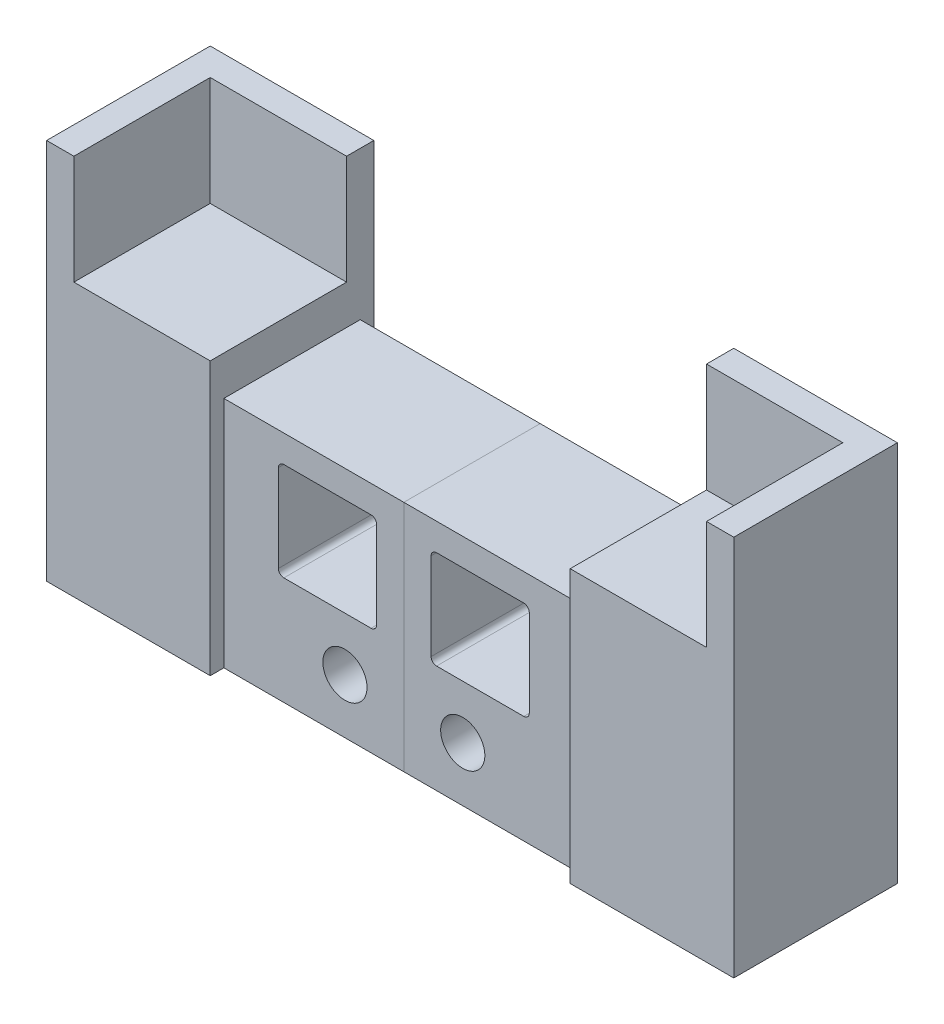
from build123d import *

# Parameters (mm, degrees)
CROQUIS1_W                   = 30
CROQUIS1_H                   = 30
SALIENTE_EXTRUIR1_DEPTH      = 50
CROQUIS2_W                   = 20
CROQUIS2_H                   = 20
CORTAR_EXTRUIR1_DEPTH        = 45
SALIENTE_EXTRUIR2_DEPTH      = 12.5
SALIENTE_EXTRUIR2_DEPTH_BACK = 12.5
CROQUIS3_W                   = 33
CROQUIS3_H                   = 42.79
CROQUIS3_R                   = 4.05
CROQUIS3_W_2                 = 18
CROQUIS3_H_2                 = 18
REDONDEO2_R                  = 1
SALIENTE_EXTRUIR3_START      = -10
CROQUIS5_W                   = 33
CROQUIS5_H                   = 15
SALIENTE_EXTRUIR3_DEPTH      = 7.5
CROQUIS6_R                   = 2
CORTAR_EXTRUIR3_DEPTH        = 28
SALIENTE_EXTRUIR4_DEPTH      = 20


with BuildPart() as part:
    # Croquis1 → Saliente-Extruir1 (new body)
    with BuildSketch(Plane(origin=(0, 0, 0), x_dir=(1, 0, 0), z_dir=(0, 1, 0))):
        Rectangle(CROQUIS1_W, CROQUIS1_H)
    extrude(amount=SALIENTE_EXTRUIR1_DEPTH)

    # Croquis2 → Cortar-Extruir1 (cut)
    with BuildSketch(Plane.XZ):
        Rectangle(CROQUIS2_W, CROQUIS2_H)
    extrude(amount=-CORTAR_EXTRUIR1_DEPTH, mode=Mode.SUBTRACT)

    # Croquis3 → Saliente-Extruir2 (add, two sides: drawn at the far end of the back side and taken through both)
    with BuildSketch(Plane.XY.offset(-SALIENTE_EXTRUIR2_DEPTH_BACK)):
        with Locations((31.5, 21.395)):
            Rectangle(CROQUIS3_W, CROQUIS3_H)
        with Locations((37.2, 10)):
            Circle(CROQUIS3_R, mode=Mode.SUBTRACT)
        with Locations((34, 28.79)):
            Rectangle(CROQUIS3_W_2, CROQUIS3_H_2, mode=Mode.SUBTRACT)
    extrude(amount=SALIENTE_EXTRUIR2_DEPTH + SALIENTE_EXTRUIR2_DEPTH_BACK)

    # Redondeo2
    redondeo2_edges = [part.edges().sort_by_distance(p)[0] for p in [
        (43, 37.79, 0),
        (43, 19.79, 0),
        (25, 19.79, 0),
        (25, 37.79, 0),
    ]]
    fillet(redondeo2_edges, radius=REDONDEO2_R)

    # Croquis5 → Saliente-Extruir3 (add)
    with BuildSketch(Plane(origin=(0, 0, -12.5), x_dir=(-1, 0, 0), z_dir=(0, 0, -1)).offset(SALIENTE_EXTRUIR3_START)):
        with Locations((-31.5, 7.5)):
            Rectangle(CROQUIS5_W, CROQUIS5_H)
    extrude(amount=-SALIENTE_EXTRUIR3_DEPTH)

    # Croquis6 → Cortar-Extruir3 (cut)
    with BuildSketch(Plane(origin=(48, 0, 0), x_dir=(0, 0, -1), z_dir=(1, 0, 0))):
        with Locations(Location((0, 28.8, 0), (0, 0, 270))):
            Circle(CROQUIS6_R)
    extrude(amount=-CORTAR_EXTRUIR3_DEPTH, mode=Mode.SUBTRACT)

    # Croquis7 → Saliente-Extruir4 (add)
    with BuildSketch(Plane(origin=(0, 50, 0), x_dir=(1, 0, 0), z_dir=(0, 1, 0))):
        Polygon((15, 15), (15, 10), (-10, 10), (-10, -15), (-15, -15), (-15, 15), align=None)
    extrude(amount=SALIENTE_EXTRUIR4_DEPTH)


with BuildPart() as body_2:
    # Simetr_a1: mirrored copy
    add(part.part.mirror(Plane(origin=(48, 42.79, -12.5), x_dir=(0, 0, 1), z_dir=(1, 0, 0))))


solid = Compound([part.part, body_2.part])
